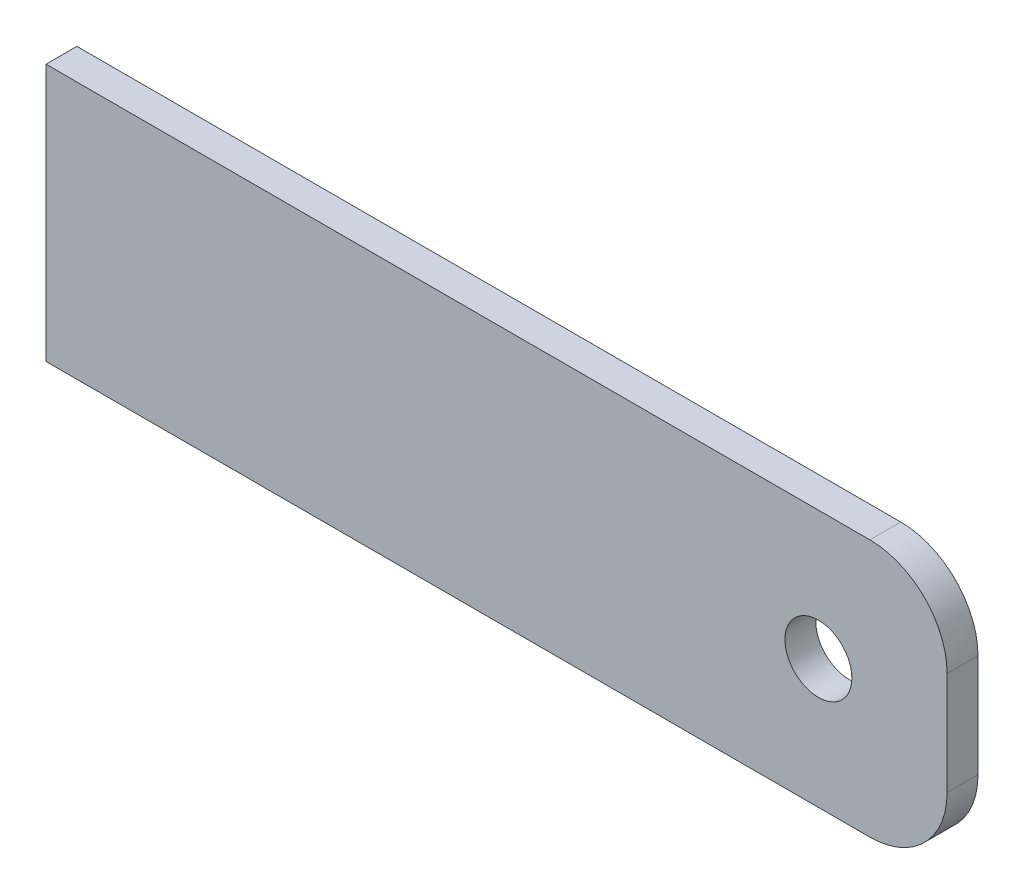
from build123d import *

# Parameters (mm, degrees)
ESQUISSE1_R          = 13
BASE_EXTRUSION_DEPTH = 12


with BuildPart() as part:
    # Esquisse1 → Base-Extrusion (new body)
    with BuildSketch(Plane.XY):
        with BuildLine():
            Line((0, 0), (320, 0))
            ThreePointArc((320, 0), (341.213203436, -8.786796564), (350, -30))
            Line((350, -30), (350, -70))
            ThreePointArc((350, -70), (341.213203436, -91.213203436), (320, -100))
            Line((320, -100), (0, -100))
            Line((0, -100), (0, 0))
        make_face()
        with Locations((300, -50)):
            Circle(ESQUISSE1_R, mode=Mode.SUBTRACT)
    extrude(amount=BASE_EXTRUSION_DEPTH)


solid = part.part
